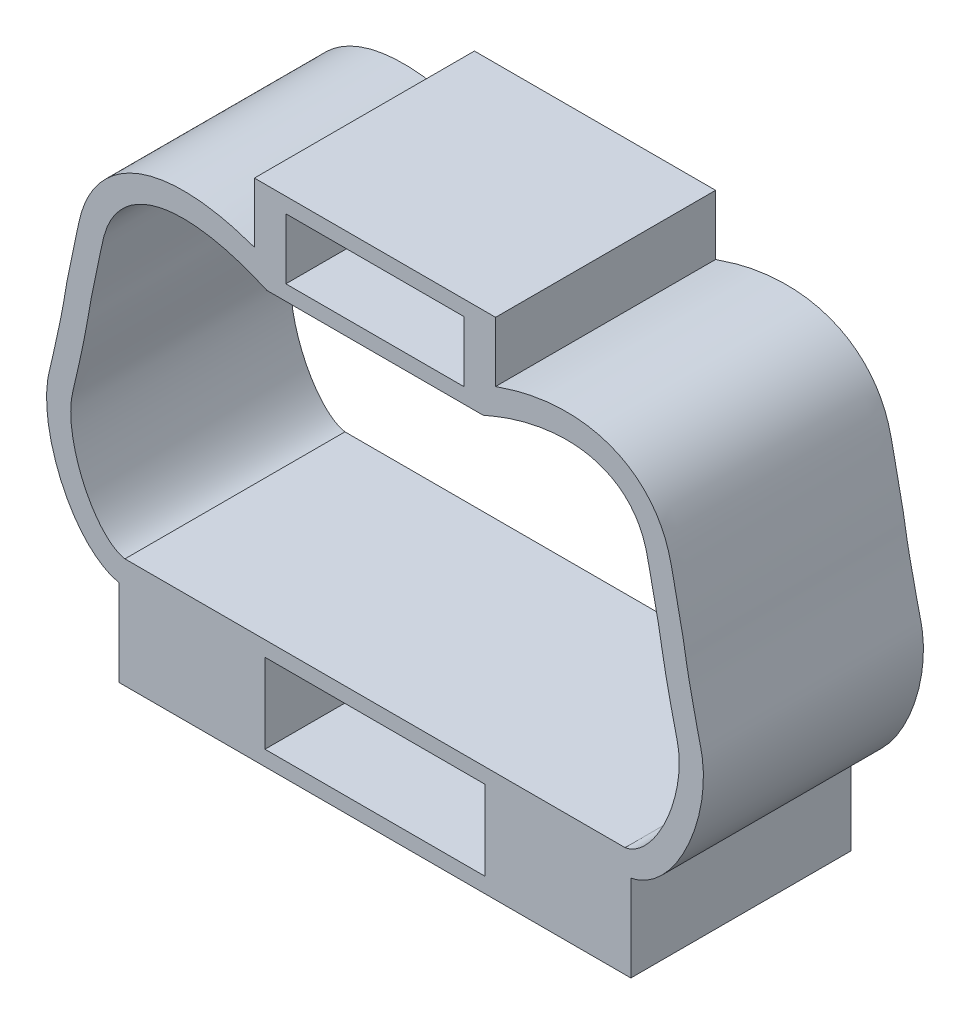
from build123d import *

# Parameters (mm, degrees)
EXTRUDE_1_DEPTH = 5.8


with BuildPart() as part:
    # Model → Extrude 1 (new body)
    with BuildSketch(Plane.XY):
        with BuildLine():
            Line((6.591935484, 0), (0, 0))
            add(Edge.make_bspline(
                [(0, 0), (-0.032449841, 0.006953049), (-0.064899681, 0.013906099), (-0.096441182, 0.023859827), (-0.135220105, 0.03609751), (-0.172626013, 0.052870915), (-0.208781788, 0.071807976), (-0.253942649, 0.09546157), (-0.297153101, 0.122490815), (-0.338493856, 0.152129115), (-0.390467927, 0.189390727), (-0.439486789, 0.230776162), (-0.486032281, 0.274697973), (-0.544303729, 0.329684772), (-0.598698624, 0.388646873), (-0.649893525, 0.450231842), (-0.712976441, 0.526117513), (-0.771200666, 0.605985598), (-0.825379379, 0.688467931), (-0.890267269, 0.787254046), (-0.949352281, 0.889790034), (-1.003365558, 0.994907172), (-1.06540609, 1.115646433), (-1.120755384, 1.239791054), (-1.169801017, 1.366370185), (-1.223100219, 1.503927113), (-1.268954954, 1.644359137), (-1.306990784, 1.786904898), (-1.345617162, 1.931663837), (-1.376179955, 2.078602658), (-1.397334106, 2.226940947), (-1.417228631, 2.366446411), (-1.428801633, 2.507189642), (-1.428670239, 2.648243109), (-1.428556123, 2.770747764), (-1.419613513, 2.893486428), (-1.398583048, 3.013918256), (-1.38096386, 3.11481527), (-1.354860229, 3.21409312), (-1.330798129, 3.313746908), (-1.309466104, 3.402094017), (-1.289738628, 3.490736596), (-1.269793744, 3.579349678), (-1.252031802, 3.658264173), (-1.234097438, 3.737155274), (-1.216441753, 3.816104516), (-1.200706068, 3.886468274), (-1.185191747, 3.956878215), (-1.169838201, 4.027324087), (-1.156147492, 4.090140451), (-1.142584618, 4.152985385), (-1.129203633, 4.215868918), (-1.117269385, 4.271953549), (-1.105479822, 4.328068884), (-1.093863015, 4.384220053), (-1.083503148, 4.434295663), (-1.073280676, 4.484399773), (-1.063229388, 4.534538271), (-1.054269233, 4.579233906), (-1.045445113, 4.623956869), (-1.036790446, 4.668712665), (-1.0290809, 4.708580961), (-1.021505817, 4.748475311), (-1.014097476, 4.788400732), (-1.007505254, 4.823927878), (-1.001045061, 4.859479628), (-0.994756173, 4.895061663), (-0.989168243, 4.926677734), (-0.98371556, 4.958317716), (-0.978418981, 4.989984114), (-0.973721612, 5.018068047), (-0.969147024, 5.046172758), (-0.964778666, 5.074309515), (-0.960816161, 5.099832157), (-0.957023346, 5.125381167), (-0.953020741, 5.150897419), (-0.94878763, 5.17788313), (-0.94431987, 5.204832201), (-0.939723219, 5.231758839), (-0.934711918, 5.261114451), (-0.929547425, 5.290443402), (-0.924262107, 5.31975057), (-0.918468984, 5.35187353), (-0.912530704, 5.383970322), (-0.906491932, 5.416048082), (-0.899836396, 5.451402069), (-0.893058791, 5.486732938), (-0.886192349, 5.522046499), (-0.878580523, 5.56119351), (-0.870859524, 5.600319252), (-0.863060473, 5.639429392), (-0.854360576, 5.68305703), (-0.845563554, 5.726665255), (-0.836696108, 5.770259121), (-0.826736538, 5.819222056), (-0.816688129, 5.868166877), (-0.806578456, 5.917099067), (-0.795137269, 5.972475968), (-0.783617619, 6.027836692), (-0.772031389, 6.083183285), (-0.758807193, 6.14635433), (-0.745496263, 6.209506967), (-0.732172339, 6.272657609), (-0.716817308, 6.345434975), (-0.701445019, 6.418209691), (-0.685836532, 6.490930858), (-0.667648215, 6.57567166), (-0.649139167, 6.660339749), (-0.631462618, 6.745200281), (-0.610725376, 6.844754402), (-0.591133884, 6.944573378), (-0.566074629, 7.043149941), (-0.539919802, 7.146036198), (-0.507808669, 7.247569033), (-0.46794439, 7.346026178), (-0.428117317, 7.444391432), (-0.380551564, 7.539686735), (-0.32521181, 7.630282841), (-0.269256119, 7.72188729), (-0.205352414, 7.808687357), (-0.133974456, 7.888870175), (-0.060449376, 7.971464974), (0.021006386, 8.04703843), (0.108786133, 8.114310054), (0.201244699, 8.185167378), (0.300719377, 8.246814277), (0.404842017, 8.299023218), (0.516832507, 8.355177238), (0.634199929, 8.400413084), (0.754373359, 8.435747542), (0.885542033, 8.474314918), (1.020053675, 8.501086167), (1.15568744, 8.518020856), (1.304656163, 8.536620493), (1.454978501, 8.54335431), (1.605053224, 8.540683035), (1.769589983, 8.53775434), (1.933829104, 8.523520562), (2.096695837, 8.500337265), (2.273854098, 8.475119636), (2.44938855, 8.43931294), (2.622977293, 8.395704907), (2.809564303, 8.348831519), (2.993903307, 8.292944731), (3.174762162, 8.227816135), (3.366425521, 8.158796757), (3.554180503, 8.079398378), (3.741935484, 8)],
                knots=[0, 0, 0, 0, 0.099348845, 0.099348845, 0.099348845, 0.22149399, 0.22149399, 0.22149399, 0.374061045, 0.374061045, 0.374061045, 0.565870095, 0.565870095, 0.565870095, 0.806000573, 0.806000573, 0.806000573, 1.101891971, 1.101891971, 1.101891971, 1.456270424, 1.456270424, 1.456270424, 1.863315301, 1.863315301, 1.863315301, 2.305661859, 2.305661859, 2.305661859, 2.754876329, 2.754876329, 2.754876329, 3.177342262, 3.177342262, 3.177342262, 3.544253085, 3.544253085, 3.544253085, 3.851648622, 3.851648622, 3.851648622, 4.124167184, 4.124167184, 4.124167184, 4.366858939, 4.366858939, 4.366858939, 4.583158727, 4.583158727, 4.583158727, 4.776032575, 4.776032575, 4.776032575, 4.948053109, 4.948053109, 4.948053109, 5.101461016, 5.101461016, 5.101461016, 5.238215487, 5.238215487, 5.238215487, 5.360035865, 5.360035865, 5.360035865, 5.468436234, 5.468436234, 5.468436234, 5.564754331, 5.564754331, 5.564754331, 5.650175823, 5.650175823, 5.650175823, 5.727661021, 5.727661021, 5.727661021, 5.809608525, 5.809608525, 5.809608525, 5.898948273, 5.898948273, 5.898948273, 5.996871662, 5.996871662, 5.996871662, 6.104796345, 6.104796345, 6.104796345, 6.224436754, 6.224436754, 6.224436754, 6.357896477, 6.357896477, 6.357896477, 6.50779325, 6.50779325, 6.50779325, 6.677432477, 6.677432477, 6.677432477, 6.871053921, 6.871053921, 6.871053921, 7.094191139, 7.094191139, 7.094191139, 7.354209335, 7.354209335, 7.354209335, 7.659249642, 7.659249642, 7.659249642, 7.977626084, 7.977626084, 7.977626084, 8.295705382, 8.295705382, 8.295705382, 8.617324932, 8.617324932, 8.617324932, 8.948619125, 8.948619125, 8.948619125, 9.2975719, 9.2975719, 9.2975719, 9.672892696, 9.672892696, 9.672892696, 10.082553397, 10.082553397, 10.082553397, 10.532490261, 10.532490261, 10.532490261, 11.025785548, 11.025785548, 11.025785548, 11.562367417, 11.562367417, 11.562367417, 12.139128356, 12.139128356, 12.139128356, 12.750344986, 12.750344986, 12.750344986, 12.750344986], degree=3))
            Line((3.741935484, 8), (6.591935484, 8))
            Line((6.591935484, 8), (6.591935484, 8.4))
            Line((6.591935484, 8.4), (4.241935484, 8.4))
            Line((4.241935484, 8.4), (4.241935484, 10))
            Line((4.241935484, 10), (6.591935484, 10))
            Line((6.591935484, 10), (6.591935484, 10.4))
            Line((6.591935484, 10.4), (3.412825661, 10.4))
            Line((3.412825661, 10.4), (3.412825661, 8.820501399))
            add(Edge.make_bspline(
                [(3.412825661, 8.820501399), (3.212682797, 8.886725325), (3.012539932, 8.952949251), (2.808898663, 9.006755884), (2.615635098, 9.057820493), (2.419220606, 9.097701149), (2.221242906, 9.126786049), (2.034350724, 9.154242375), (1.846065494, 9.172078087), (1.657292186, 9.17725286), (1.479188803, 9.182135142), (1.300650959, 9.175747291), (1.123517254, 9.155919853), (0.955631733, 9.13712761), (0.789007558, 9.106262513), (0.626099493, 9.061443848), (0.47040762, 9.018610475), (0.31810993, 8.963032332), (0.172168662, 8.893845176), (0.031458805, 8.827138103), (-0.103342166, 8.747780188), (-0.229305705, 8.656199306), (-0.351464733, 8.567384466), (-0.465312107, 8.467073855), (-0.568605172, 8.356893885), (-0.668970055, 8.249837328), (-0.759370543, 8.133463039), (-0.838744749, 8.010064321), (-0.915865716, 7.890168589), (-0.982577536, 7.76364158), (-1.03873753, 7.632636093), (-1.093323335, 7.505302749), (-1.137940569, 7.373738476), (-1.17368863, 7.240013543), (-1.20529721, 7.121773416), (-1.229971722, 7.001844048), (-1.25532552, 6.882113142), (-1.273520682, 6.796188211), (-1.292065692, 6.710365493), (-1.310424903, 6.624495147), (-1.32604157, 6.551452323), (-1.341523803, 6.478375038), (-1.356959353, 6.405289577), (-1.370376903, 6.341759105), (-1.383759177, 6.278222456), (-1.397060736, 6.21466852), (-1.408743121, 6.158850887), (-1.420363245, 6.103019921), (-1.431903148, 6.047172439), (-1.442134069, 5.997659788), (-1.452301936, 5.948134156), (-1.462380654, 5.89859034), (-1.471395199, 5.854277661), (-1.480338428, 5.809950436), (-1.489183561, 5.7656036), (-1.497162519, 5.725599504), (-1.505061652, 5.68557945), (-1.512850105, 5.645537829), (-1.51993642, 5.60910601), (-1.526931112, 5.572656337), (-1.533801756, 5.536183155), (-1.540109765, 5.502696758), (-1.546313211, 5.469190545), (-1.552366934, 5.435657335), (-1.557980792, 5.404560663), (-1.563465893, 5.373440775), (-1.568795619, 5.342293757), (-1.573795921, 5.313071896), (-1.578659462, 5.283826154), (-1.58326534, 5.254540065), (-1.587630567, 5.226784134), (-1.591764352, 5.198991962), (-1.596091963, 5.171229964), (-1.60021405, 5.144786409), (-1.60451199, 5.11837023), (-1.60893301, 5.091974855), (-1.613882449, 5.062424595), (-1.618986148, 5.032900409), (-1.624210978, 5.003397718), (-1.63018, 4.969692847), (-1.636307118, 4.93601603), (-1.642558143, 4.902362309), (-1.649663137, 4.864111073), (-1.656928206, 4.825889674), (-1.664320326, 4.78769292), (-1.672691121, 4.744439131), (-1.681224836, 4.701216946), (-1.689888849, 4.658020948), (-1.69967374, 4.609236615), (-1.709624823, 4.560485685), (-1.719708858, 4.511762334), (-1.731076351, 4.456837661), (-1.742612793, 4.401948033), (-1.754288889, 4.347088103), (-1.767435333, 4.285319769), (-1.780758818, 4.223589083), (-1.794212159, 4.161887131), (-1.809349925, 4.092459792), (-1.8246521, 4.023068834), (-1.840150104, 3.95371972), (-1.857585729, 3.875700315), (-1.875269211, 3.797733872), (-1.8928788, 3.719760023), (-1.912695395, 3.63201373), (-1.932418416, 3.544258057), (-1.953299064, 3.456724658), (-1.977251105, 3.356315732), (-2.002726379, 3.256199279), (-2.021570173, 3.154762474), (-2.049340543, 3.005273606), (-2.062708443, 2.852917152), (-2.065228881, 2.700618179), (-2.068112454, 2.526376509), (-2.056797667, 2.352210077), (-2.034284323, 2.179565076), (-2.011384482, 2.00395619), (-1.97689828, 1.829921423), (-1.932650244, 1.658451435), (-1.889789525, 1.492357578), (-1.837769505, 1.328670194), (-1.777016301, 1.16828018), (-1.720955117, 1.020277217), (-1.657457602, 0.875081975), (-1.586242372, 0.733746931), (-1.523018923, 0.60827252), (-1.453712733, 0.485840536), (-1.377686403, 0.367676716), (-1.311787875, 0.265254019), (-1.240840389, 0.166038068), (-1.164148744, 0.071428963), (-1.098169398, -0.009965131), (-1.027938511, -0.087949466), (-0.952925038, -0.161147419), (-0.887868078, -0.224629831), (-0.819213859, -0.284512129), (-0.746638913, -0.339162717), (-0.682447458, -0.387500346), (-0.615188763, -0.431745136), (-0.545039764, -0.471221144), (-0.48147915, -0.50698957), (-0.41554565, -0.538842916), (-0.347167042, -0.563580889), (-0.283968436, -0.586444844), (-0.218681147, -0.603230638), (-0.153393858, -0.620016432)],
                knots=[-14.228654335, -14.228654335, -14.228654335, -14.228654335, -13.596658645, -13.596658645, -13.596658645, -12.996869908, -12.996869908, -12.996869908, -12.430665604, -12.430665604, -12.430665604, -11.896464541, -11.896464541, -11.896464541, -11.390154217, -11.390154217, -11.390154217, -10.906271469, -10.906271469, -10.906271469, -10.439733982, -10.439733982, -10.439733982, -9.987287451, -9.987287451, -9.987287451, -9.547667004, -9.547667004, -9.547667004, -9.120526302, -9.120526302, -9.120526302, -8.705358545, -8.705358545, -8.705358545, -8.338265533, -8.338265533, -8.338265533, -8.074821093, -8.074821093, -8.074821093, -7.850730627, -7.850730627, -7.850730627, -7.655937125, -7.655937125, -7.655937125, -7.484855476, -7.484855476, -7.484855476, -7.333179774, -7.333179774, -7.333179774, -7.197518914, -7.197518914, -7.197518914, -7.075142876, -7.075142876, -7.075142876, -6.96379919, -6.96379919, -6.96379919, -6.861573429, -6.861573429, -6.861573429, -6.766775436, -6.766775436, -6.766775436, -6.677836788, -6.677836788, -6.677836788, -6.593545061, -6.593545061, -6.593545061, -6.513256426, -6.513256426, -6.513256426, -6.423371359, -6.423371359, -6.423371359, -6.320683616, -6.320683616, -6.320683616, -6.203967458, -6.203967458, -6.203967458, -6.071798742, -6.071798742, -6.071798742, -5.922531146, -5.922531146, -5.922531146, -5.754265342, -5.754265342, -5.754265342, -5.564810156, -5.564810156, -5.564810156, -5.351634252, -5.351634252, -5.351634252, -5.111806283, -5.111806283, -5.111806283, -4.84192073, -4.84192073, -4.84192073, -4.532336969, -4.532336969, -4.532336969, -4.076098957, -4.076098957, -4.076098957, -3.554127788, -3.554127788, -3.554127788, -3.023195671, -3.023195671, -3.023195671, -2.508909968, -2.508909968, -2.508909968, -2.03434297, -2.03434297, -2.03434297, -1.613031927, -1.613031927, -1.613031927, -1.247845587, -1.247845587, -1.247845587, -0.933668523, -0.933668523, -0.933668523, -0.66119208, -0.66119208, -0.66119208, -0.420190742, -0.420190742, -0.420190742, -0.201824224, -0.201824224, -0.201824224, 0, 0, 0, 0], degree=3))
            Line((-0.153393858, -0.620016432), (-0.153393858, -2.9))
            Line((-0.153393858, -2.9), (6.591935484, -2.9))
            Line((6.591935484, -2.9), (6.591935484, -2.5))
            Line((6.591935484, -2.5), (3.691935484, -2.5))
            Line((3.691935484, -2.5), (3.691935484, -0.4))
            Line((3.691935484, -0.4), (6.591935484, -0.4))
            Line((6.591935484, -0.4), (6.591935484, 0))
        make_face()
    extrude_1 = extrude(amount=EXTRUDE_1_DEPTH)

    # Mirror 1: Extrude 1 across plane
    add(extrude_1.mirror(Plane(origin=(6.591935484, 8, 5.8), x_dir=(0, 0, 1), z_dir=(-1, 0, 0))))


solid = part.part
